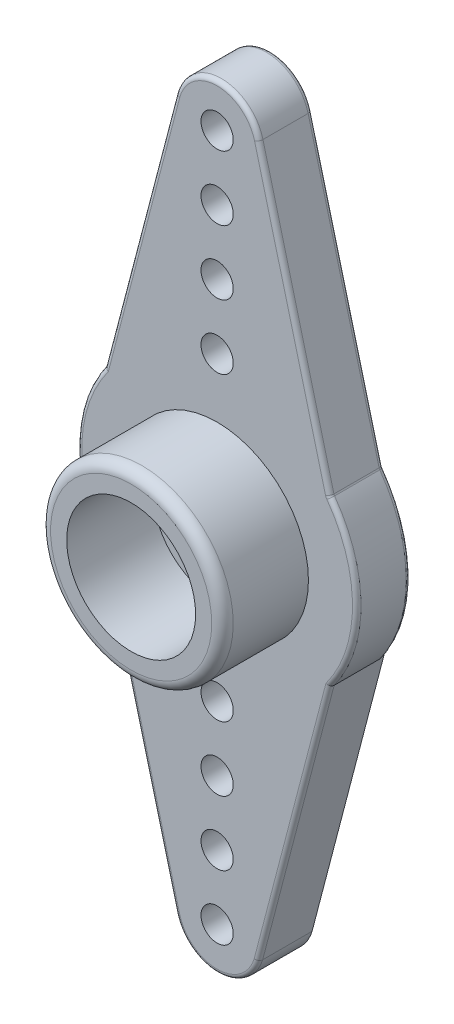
from build123d import *

# Parameters (mm, degrees)
SKETCH1_R           = 0.75
SKETCH1_R_2         = 1.5
BOSS_EXTRUDE1_DEPTH = 2.5
SKETCH2_R           = 4.25
SKETCH2_R_2         = 3
BOSS_EXTRUDE2_DEPTH = 4
SKETCH3_R           = 4.5
CUT_EXTRUDE1_DEPTH  = 0.8
SKETCH4_R           = 3.7
SKETCH4_R_2         = 3.5
BOSS_EXTRUDE3_DEPTH = 1
FILLET2_R           = 0.5
FILLET3_R           = 0.2


with BuildPart() as part:
    # Sketch1 → Boss-Extrude1 (new body)
    with BuildSketch(Plane.XY):
        with BuildLine():
            Line((1.934972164, 16.505848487), (5.247058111, 3.836454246))
            ThreePointArc((5.247058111, 3.836454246), (6.499999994, -0.000272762), (5.246736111, -3.836894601))
            Line((5.246736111, -3.836894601), (1.919269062, -16.5625))
            ThreePointArc((1.919269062, -16.5625), (0, -17.999999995), (-1.919269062, -16.562499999))
            Line((-1.919269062, -16.562499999), (-5.246736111, -3.836894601))
            ThreePointArc((-5.246736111, -3.836894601), (-6.499999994, -0.000272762), (-5.247058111, 3.836454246))
            Line((-5.247058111, 3.836454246), (-1.934972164, 16.505848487))
            ThreePointArc((-1.934972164, 16.505848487), (0, 17.999999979), (1.934972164, 16.505848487))
        make_face()
        with Locations((0, 7)):
            Circle(SKETCH1_R, mode=Mode.SUBTRACT)
        with Locations((0, 10)):
            Circle(SKETCH1_R, mode=Mode.SUBTRACT)
        with Locations((0, 13)):
            Circle(SKETCH1_R, mode=Mode.SUBTRACT)
        with Locations((0, 16)):
            Circle(SKETCH1_R, mode=Mode.SUBTRACT)
        Circle(SKETCH1_R_2, mode=Mode.SUBTRACT)
        with Locations((0, -16)):
            Circle(SKETCH1_R, mode=Mode.SUBTRACT)
        with Locations((0, -13)):
            Circle(SKETCH1_R, mode=Mode.SUBTRACT)
        with Locations((0, -10)):
            Circle(SKETCH1_R, mode=Mode.SUBTRACT)
        with Locations((0, -7)):
            Circle(SKETCH1_R, mode=Mode.SUBTRACT)
    extrude(amount=BOSS_EXTRUDE1_DEPTH)

    # Sketch2 → Boss-Extrude2 (add)
    with BuildSketch(Plane.XY.offset(2.5)):
        Circle(SKETCH2_R)
        Circle(SKETCH2_R_2, mode=Mode.SUBTRACT)
    extrude(amount=BOSS_EXTRUDE2_DEPTH)

    # Sketch3 → Cut-Extrude1 (cut)
    with BuildSketch(Plane(origin=(0, 0, 0), x_dir=(-1, 0, 0), z_dir=(0, 0, -1))):
        Circle(SKETCH3_R)
    extrude(amount=-CUT_EXTRUDE1_DEPTH, mode=Mode.SUBTRACT)

    # Sketch4 → Boss-Extrude3 (add)
    with BuildSketch(Plane(origin=(0, 0, 0.8), x_dir=(-1, 0, 0), z_dir=(0, 0, -1))):
        Circle(SKETCH4_R)
        Circle(SKETCH4_R_2, mode=Mode.SUBTRACT)
    extrude(amount=BOSS_EXTRUDE3_DEPTH)

    # Fillet2
    fillet2_edges = [part.edges().sort_by_distance(p)[0] for p in [
        (-4.25, 0, 6.5),
    ]]
    fillet(fillet2_edges, radius=FILLET2_R)

    # Fillet3
    fillet3_edges = [part.edges().sort_by_distance(p)[0] for p in [
        (3.583002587, -10.1996973, 2.5),
        (0, -17.999999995, 2.5),
        (-3.583002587, -10.1996973, 2.5),
        (-3.591015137, 10.171151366, 2.5),
        (0, 17.999999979, 2.5),
        (-3.591015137, 10.171151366, 0),
        (0, 17.999999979, 0),
        (3.591015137, 10.171151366, 2.5),
        (3.591015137, 10.171151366, 0),
        (6.499999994, -0.000272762, 2.5),
        (6.499999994, -0.000272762, 0),
        (5.247058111, 3.836454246, 1.25),
        (-6.499999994, -0.000272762, 2.5),
    ]]
    fillet(fillet3_edges, radius=FILLET3_R)


solid = part.part
